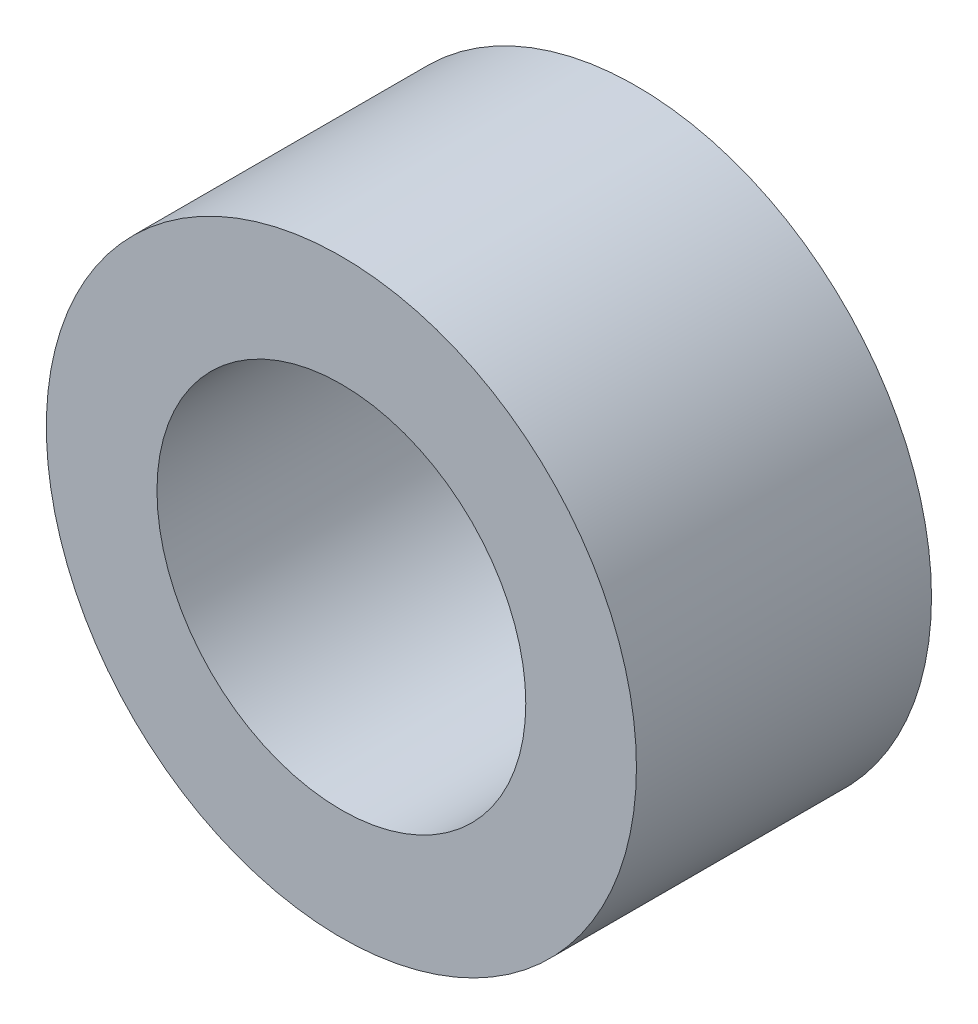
ISO-10303-21;
HEADER;
FILE_DESCRIPTION(('STEP AP214'),'2;1');
FILE_NAME('part.step','',(''),(''),'','','');
FILE_SCHEMA(('AUTOMOTIVE_DESIGN { 1 0 10303 214 1 1 1 1 }'));
ENDSEC;
DATA;
#1=APPLICATION_CONTEXT('core data for automotive mechanical design processes');
#2=APPLICATION_PROTOCOL_DEFINITION('international standard','automotive_design',2000,#1);
#3=PRODUCT_CONTEXT('',#1,'mechanical');
#4=PRODUCT('Part','Part','',(#3));
#5=PRODUCT_RELATED_PRODUCT_CATEGORY('part','',(#4));
#6=PRODUCT_DEFINITION_FORMATION('','',#4);
#7=PRODUCT_DEFINITION_CONTEXT('part definition',#1,'design');
#8=PRODUCT_DEFINITION('design','',#6,#7);
#9=PRODUCT_DEFINITION_SHAPE('','',#8);
#10=(LENGTH_UNIT() NAMED_UNIT(*) SI_UNIT(.MILLI.,.METRE.));
#11=(NAMED_UNIT(*) PLANE_ANGLE_UNIT() SI_UNIT($,.RADIAN.));
#12=(NAMED_UNIT(*) SI_UNIT($,.STERADIAN.) SOLID_ANGLE_UNIT());
#13=UNCERTAINTY_MEASURE_WITH_UNIT(LENGTH_MEASURE(1.E-05),#10,'distance_accuracy_value','');
#14=(GEOMETRIC_REPRESENTATION_CONTEXT(3) GLOBAL_UNCERTAINTY_ASSIGNED_CONTEXT((#13)) GLOBAL_UNIT_ASSIGNED_CONTEXT((#10,
#11,#12)) REPRESENTATION_CONTEXT('',''));
#15=CARTESIAN_POINT('',(0.,0.,0.));
#16=DIRECTION('',(0.,0.,1.));
#17=DIRECTION('',(1.,0.,0.));
#18=AXIS2_PLACEMENT_3D('',#15,#16,#17);
#19=CARTESIAN_POINT('',(0.,0.,4.));
#20=DIRECTION('',(0.,0.,1.));
#21=DIRECTION('',(1.,0.,0.));
#22=AXIS2_PLACEMENT_3D('',#19,#20,#21);
#23=PLANE('',#22);
#24=CARTESIAN_POINT('',(0.,0.,4.));
#25=DIRECTION('',(0.,0.,1.));
#26=DIRECTION('',(1.,0.,0.));
#27=AXIS2_PLACEMENT_3D('',#24,#25,#26);
#28=CIRCLE('',#27,4.);
#29=CARTESIAN_POINT('',(4.,0.,4.));
#30=VERTEX_POINT('',#29);
#31=EDGE_CURVE('E10',#30,#30,#28,.T.);
#32=ORIENTED_EDGE('',*,*,#31,.T.);
#33=EDGE_LOOP('',(#32));
#34=FACE_BOUND('',#33,.T.);
#35=CARTESIAN_POINT('',(0.,0.,4.));
#36=DIRECTION('',(0.,0.,1.));
#37=DIRECTION('',(1.,0.,0.));
#38=AXIS2_PLACEMENT_3D('',#35,#36,#37);
#39=CIRCLE('',#38,2.5);
#40=CARTESIAN_POINT('',(2.5,0.,4.));
#41=VERTEX_POINT('',#40);
#42=EDGE_CURVE('E44',#41,#41,#39,.T.);
#43=ORIENTED_EDGE('',*,*,#42,.F.);
#44=EDGE_LOOP('',(#43));
#45=FACE_BOUND('',#44,.T.);
#46=ADVANCED_FACE('F33',(#34,#45),#23,.T.);
#47=CARTESIAN_POINT('',(0.,0.,0.));
#48=DIRECTION('',(0.,0.,1.));
#49=DIRECTION('',(1.,0.,0.));
#50=AXIS2_PLACEMENT_3D('',#47,#48,#49);
#51=PLANE('',#50);
#52=CARTESIAN_POINT('',(0.,0.,0.));
#53=DIRECTION('',(0.,0.,1.));
#54=DIRECTION('',(1.,0.,0.));
#55=AXIS2_PLACEMENT_3D('',#52,#53,#54);
#56=CIRCLE('',#55,4.);
#57=CARTESIAN_POINT('',(4.,0.,0.));
#58=VERTEX_POINT('',#57);
#59=EDGE_CURVE('E37',#58,#58,#56,.T.);
#60=ORIENTED_EDGE('',*,*,#59,.F.);
#61=EDGE_LOOP('',(#60));
#62=FACE_BOUND('',#61,.T.);
#63=CARTESIAN_POINT('',(0.,0.,0.));
#64=DIRECTION('',(0.,0.,1.));
#65=DIRECTION('',(1.,0.,0.));
#66=AXIS2_PLACEMENT_3D('',#63,#64,#65);
#67=CIRCLE('',#66,2.5);
#68=CARTESIAN_POINT('',(2.5,0.,0.));
#69=VERTEX_POINT('',#68);
#70=EDGE_CURVE('E46',#69,#69,#67,.T.);
#71=ORIENTED_EDGE('',*,*,#70,.T.);
#72=EDGE_LOOP('',(#71));
#73=FACE_BOUND('',#72,.T.);
#74=ADVANCED_FACE('F56',(#62,#73),#51,.F.);
#75=CARTESIAN_POINT('',(0.,0.,4.));
#76=DIRECTION('',(0.,0.,-1.));
#77=DIRECTION('',(-1.,0.,0.));
#78=AXIS2_PLACEMENT_3D('',#75,#76,#77);
#79=CYLINDRICAL_SURFACE('',#78,4.);
#80=ORIENTED_EDGE('',*,*,#31,.F.);
#81=EDGE_LOOP('',(#80));
#82=FACE_BOUND('',#81,.T.);
#83=ORIENTED_EDGE('',*,*,#59,.T.);
#84=EDGE_LOOP('',(#83));
#85=FACE_BOUND('',#84,.T.);
#86=ADVANCED_FACE('F35',(#82,#85),#79,.T.);
#87=CARTESIAN_POINT('',(0.,0.,4.));
#88=DIRECTION('',(0.,0.,-1.));
#89=DIRECTION('',(-1.,0.,0.));
#90=AXIS2_PLACEMENT_3D('',#87,#88,#89);
#91=CYLINDRICAL_SURFACE('',#90,2.5);
#92=ORIENTED_EDGE('',*,*,#42,.T.);
#93=EDGE_LOOP('',(#92));
#94=FACE_BOUND('',#93,.T.);
#95=ORIENTED_EDGE('',*,*,#70,.F.);
#96=EDGE_LOOP('',(#95));
#97=FACE_BOUND('',#96,.T.);
#98=ADVANCED_FACE('F52',(#94,#97),#91,.F.);
#99=CLOSED_SHELL('',(#46,#74,#86,#98));
#100=MANIFOLD_SOLID_BREP('B2',#99);
#101=ADVANCED_BREP_SHAPE_REPRESENTATION('',(#18,#100),#14);
#102=SHAPE_DEFINITION_REPRESENTATION(#9,#101);
ENDSEC;
END-ISO-10303-21;
